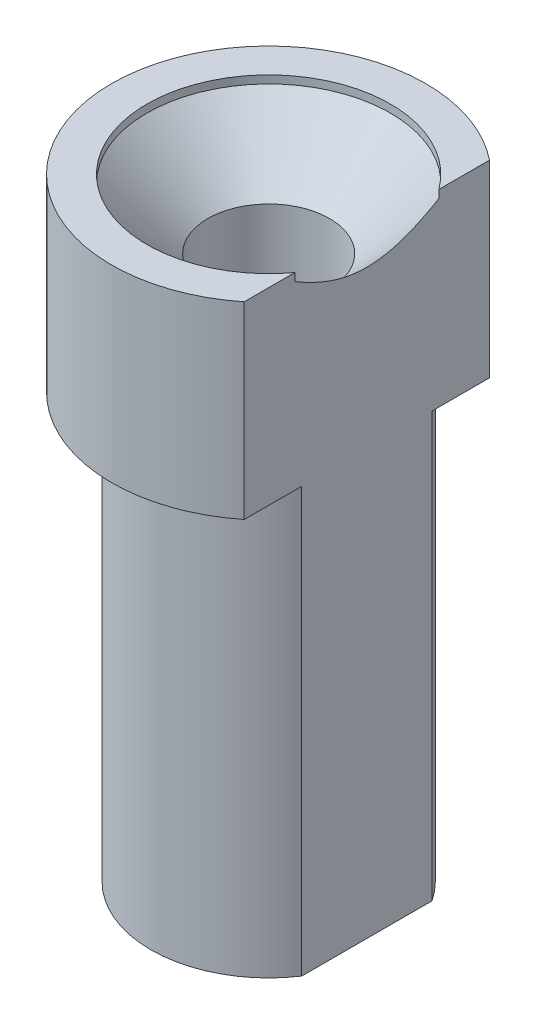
ISO-10303-21;
HEADER;
FILE_DESCRIPTION(('STEP AP214'),'2;1');
FILE_NAME('part.step','',(''),(''),'','','');
FILE_SCHEMA(('AUTOMOTIVE_DESIGN { 1 0 10303 214 1 1 1 1 }'));
ENDSEC;
DATA;
#1=APPLICATION_CONTEXT('core data for automotive mechanical design processes');
#2=APPLICATION_PROTOCOL_DEFINITION('international standard','automotive_design',2000,#1);
#3=PRODUCT_CONTEXT('',#1,'mechanical');
#4=PRODUCT('Part','Part','',(#3));
#5=PRODUCT_RELATED_PRODUCT_CATEGORY('part','',(#4));
#6=PRODUCT_DEFINITION_FORMATION('','',#4);
#7=PRODUCT_DEFINITION_CONTEXT('part definition',#1,'design');
#8=PRODUCT_DEFINITION('design','',#6,#7);
#9=PRODUCT_DEFINITION_SHAPE('','',#8);
#10=(LENGTH_UNIT() NAMED_UNIT(*) SI_UNIT(.MILLI.,.METRE.));
#11=(NAMED_UNIT(*) PLANE_ANGLE_UNIT() SI_UNIT($,.RADIAN.));
#12=(NAMED_UNIT(*) SI_UNIT($,.STERADIAN.) SOLID_ANGLE_UNIT());
#13=UNCERTAINTY_MEASURE_WITH_UNIT(LENGTH_MEASURE(1.E-05),#10,'distance_accuracy_value','');
#14=(GEOMETRIC_REPRESENTATION_CONTEXT(3) GLOBAL_UNCERTAINTY_ASSIGNED_CONTEXT((#13)) GLOBAL_UNIT_ASSIGNED_CONTEXT((#10,
#11,#12)) REPRESENTATION_CONTEXT('',''));
#15=CARTESIAN_POINT('',(0.,0.,0.));
#16=DIRECTION('',(0.,0.,1.));
#17=DIRECTION('',(1.,0.,0.));
#18=AXIS2_PLACEMENT_3D('',#15,#16,#17);
#19=CARTESIAN_POINT('',(0.,0.,0.));
#20=DIRECTION('',(0.,1.,0.));
#21=DIRECTION('',(0.,0.,1.));
#22=AXIS2_PLACEMENT_3D('',#19,#20,#21);
#23=CYLINDRICAL_SURFACE('',#22,3.);
#24=DIRECTION('',(0.,1.,0.));
#25=VECTOR('',#24,1.);
#26=CARTESIAN_POINT('',(-2.5,0.,1.6583123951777));
#27=LINE('',#26,#25);
#28=CARTESIAN_POINT('',(-2.5,0.,1.6583123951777));
#29=VERTEX_POINT('',#28);
#30=CARTESIAN_POINT('',(-2.5,5.1,1.6583123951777));
#31=VERTEX_POINT('',#30);
#32=EDGE_CURVE('E108',#29,#31,#27,.T.);
#33=ORIENTED_EDGE('',*,*,#32,.F.);
#34=CARTESIAN_POINT('',(0.,0.,0.));
#35=DIRECTION('',(0.,1.,0.));
#36=DIRECTION('',(0.,0.,1.));
#37=AXIS2_PLACEMENT_3D('',#34,#35,#36);
#38=CIRCLE('',#37,3.);
#39=CARTESIAN_POINT('',(2.5,0.,1.6583123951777));
#40=VERTEX_POINT('',#39);
#41=EDGE_CURVE('E117',#29,#40,#38,.T.);
#42=ORIENTED_EDGE('',*,*,#41,.T.);
#43=DIRECTION('',(0.,1.,0.));
#44=VECTOR('',#43,1.);
#45=CARTESIAN_POINT('',(2.5,0.,1.6583123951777));
#46=LINE('',#45,#44);
#47=CARTESIAN_POINT('',(2.5,10.8,1.6583123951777));
#48=VERTEX_POINT('',#47);
#49=EDGE_CURVE('E137',#48,#40,#46,.F.);
#50=ORIENTED_EDGE('',*,*,#49,.F.);
#51=CARTESIAN_POINT('',(0.,10.8,0.));
#52=DIRECTION('',(0.,1.,0.));
#53=DIRECTION('',(0.,0.,1.));
#54=AXIS2_PLACEMENT_3D('',#51,#52,#53);
#55=CIRCLE('',#54,3.);
#56=CARTESIAN_POINT('',(2.5,10.8,-1.6583123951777));
#57=VERTEX_POINT('',#56);
#58=EDGE_CURVE('E145',#57,#48,#55,.T.);
#59=ORIENTED_EDGE('',*,*,#58,.F.);
#60=DIRECTION('',(0.,1.,0.));
#61=VECTOR('',#60,1.);
#62=CARTESIAN_POINT('',(2.5,0.,-1.6583123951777));
#63=LINE('',#62,#61);
#64=CARTESIAN_POINT('',(2.5,0.,-1.6583123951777));
#65=VERTEX_POINT('',#64);
#66=EDGE_CURVE('E65',#65,#57,#63,.T.);
#67=ORIENTED_EDGE('',*,*,#66,.F.);
#68=CARTESIAN_POINT('',(-2.5,0.,-1.6583123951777));
#69=VERTEX_POINT('',#68);
#70=EDGE_CURVE('E123',#65,#69,#38,.T.);
#71=ORIENTED_EDGE('',*,*,#70,.T.);
#72=DIRECTION('',(0.,1.,0.));
#73=VECTOR('',#72,1.);
#74=CARTESIAN_POINT('',(-2.5,0.,-1.6583123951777));
#75=LINE('',#74,#73);
#76=CARTESIAN_POINT('',(-2.5,5.1,-1.6583123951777));
#77=VERTEX_POINT('',#76);
#78=EDGE_CURVE('E57',#77,#69,#75,.F.);
#79=ORIENTED_EDGE('',*,*,#78,.F.);
#80=CARTESIAN_POINT('',(0.,5.1,0.));
#81=DIRECTION('',(0.,1.,0.));
#82=DIRECTION('',(0.,0.,1.));
#83=AXIS2_PLACEMENT_3D('',#80,#81,#82);
#84=CIRCLE('',#83,3.);
#85=EDGE_CURVE('E11',#77,#31,#84,.T.);
#86=ORIENTED_EDGE('',*,*,#85,.T.);
#87=EDGE_LOOP('',(#33,#42,#50,#59,#67,#71,#79,#86));
#88=FACE_BOUND('',#87,.T.);
#89=ADVANCED_FACE('F43',(#88),#23,.T.);
#90=CARTESIAN_POINT('',(0.,0.,-1.55));
#91=DIRECTION('',(0.,1.,0.));
#92=DIRECTION('',(0.,0.,1.));
#93=AXIS2_PLACEMENT_3D('',#90,#91,#92);
#94=PLANE('',#93);
#95=CARTESIAN_POINT('',(0.,0.,0.));
#96=DIRECTION('',(0.,1.,0.));
#97=DIRECTION('',(0.,0.,1.));
#98=AXIS2_PLACEMENT_3D('',#95,#96,#97);
#99=CIRCLE('',#98,1.55);
#100=CARTESIAN_POINT('',(0.,0.,1.55));
#101=VERTEX_POINT('',#100);
#102=EDGE_CURVE('E124',#101,#101,#99,.T.);
#103=ORIENTED_EDGE('',*,*,#102,.T.);
#104=EDGE_LOOP('',(#103));
#105=FACE_BOUND('',#104,.T.);
#106=DIRECTION('',(0.,0.,1.));
#107=VECTOR('',#106,1.);
#108=CARTESIAN_POINT('',(-2.5,0.,-1.55));
#109=LINE('',#108,#107);
#110=EDGE_CURVE('E50',#69,#29,#109,.T.);
#111=ORIENTED_EDGE('',*,*,#110,.F.);
#112=ORIENTED_EDGE('',*,*,#70,.F.);
#113=DIRECTION('',(0.,0.,1.));
#114=VECTOR('',#113,1.);
#115=CARTESIAN_POINT('',(2.5,0.,6.44896517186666));
#116=LINE('',#115,#114);
#117=EDGE_CURVE('E119',#65,#40,#116,.T.);
#118=ORIENTED_EDGE('',*,*,#117,.T.);
#119=ORIENTED_EDGE('',*,*,#41,.F.);
#120=EDGE_LOOP('',(#111,#112,#118,#119));
#121=FACE_BOUND('',#120,.T.);
#122=ADVANCED_FACE('F122',(#105,#121),#94,.F.);
#123=CARTESIAN_POINT('',(0.,15.4,0.));
#124=DIRECTION('',(0.,1.,0.));
#125=DIRECTION('',(0.,0.,1.));
#126=AXIS2_PLACEMENT_3D('',#123,#124,#125);
#127=CONICAL_SURFACE('',#126,3.1,0.78539816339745);
#128=CARTESIAN_POINT('',(0.,13.85,0.));
#129=DIRECTION('',(0.,1.,0.));
#130=DIRECTION('',(0.,0.,1.));
#131=AXIS2_PLACEMENT_3D('',#128,#129,#130);
#132=CIRCLE('',#131,1.55);
#133=CARTESIAN_POINT('',(0.,13.85,1.55));
#134=VERTEX_POINT('',#133);
#135=EDGE_CURVE('E128',#134,#134,#132,.T.);
#136=ORIENTED_EDGE('',*,*,#135,.F.);
#137=EDGE_LOOP('',(#136));
#138=FACE_BOUND('',#137,.T.);
#139=CARTESIAN_POINT('',(2.5,17.52888082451,-4.59251507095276));
#140=CARTESIAN_POINT('',(2.5,17.4335333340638,-4.4839363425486));
#141=CARTESIAN_POINT('',(2.5,17.3386019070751,-4.37498826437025));
#142=CARTESIAN_POINT('',(2.5,17.1497957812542,-4.15615520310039));
#143=CARTESIAN_POINT('',(2.5,17.0559212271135,-4.04627009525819));
#144=CARTESIAN_POINT('',(2.5,16.8689517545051,-3.82476898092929));
#145=CARTESIAN_POINT('',(2.5,16.7758642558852,-3.71314669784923));
#146=CARTESIAN_POINT('',(2.5,16.5913616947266,-3.4885371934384));
#147=CARTESIAN_POINT('',(2.5,16.4999465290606,-3.37555005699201));
#148=CARTESIAN_POINT('',(2.5,16.3128963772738,-3.13987881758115));
#149=CARTESIAN_POINT('',(2.5,16.217416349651,-3.01707128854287));
#150=CARTESIAN_POINT('',(2.5,16.029711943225,-2.76899569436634));
#151=CARTESIAN_POINT('',(2.5,15.9374872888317,-2.64372783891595));
#152=CARTESIAN_POINT('',(2.5,15.7576881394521,-2.39030775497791));
#153=CARTESIAN_POINT('',(2.5,15.6701035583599,-2.2621627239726));
#154=CARTESIAN_POINT('',(2.5,15.5011800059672,-2.00184568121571));
#155=CARTESIAN_POINT('',(2.5,15.4198380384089,-1.86967564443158));
#156=CARTESIAN_POINT('',(2.5,15.2908857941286,-1.64347647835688));
#157=CARTESIAN_POINT('',(2.5,15.2408377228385,-1.55084456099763));
#158=CARTESIAN_POINT('',(2.5,15.1461523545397,-1.36278791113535));
#159=CARTESIAN_POINT('',(2.5,15.1015166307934,-1.26736237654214));
#160=CARTESIAN_POINT('',(2.5,15.0197454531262,-1.07450353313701));
#161=CARTESIAN_POINT('',(2.5,14.9825355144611,-0.97710222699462));
#162=CARTESIAN_POINT('',(2.5,14.9170025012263,-0.779343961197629));
#163=CARTESIAN_POINT('',(2.5,14.8886740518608,-0.678988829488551));
#164=CARTESIAN_POINT('',(2.5,14.8493647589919,-0.50431643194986));
#165=CARTESIAN_POINT('',(2.5,14.8357467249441,-0.430593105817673));
#166=CARTESIAN_POINT('',(2.5,14.8148126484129,-0.282253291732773));
#167=CARTESIAN_POINT('',(2.5,14.8074954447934,-0.207636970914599));
#168=CARTESIAN_POINT('',(2.5,14.7995637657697,-0.0581485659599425));
#169=CARTESIAN_POINT('',(2.5,14.798939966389,0.0167230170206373));
#170=CARTESIAN_POINT('',(2.5,14.8044058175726,0.166222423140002));
#171=CARTESIAN_POINT('',(2.5,14.8104959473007,0.240850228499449));
#172=CARTESIAN_POINT('',(2.5,14.8290002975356,0.388850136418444));
#173=CARTESIAN_POINT('',(2.5,14.8413763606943,0.462227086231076));
#174=CARTESIAN_POINT('',(2.5,14.8718357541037,0.607790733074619));
#175=CARTESIAN_POINT('',(2.5,14.8899206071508,0.679977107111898));
#176=CARTESIAN_POINT('',(2.5,14.9311264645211,0.823130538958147));
#177=CARTESIAN_POINT('',(2.5,14.9542633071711,0.894092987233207));
#178=CARTESIAN_POINT('',(2.5,15.0047800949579,1.0344676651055));
#179=CARTESIAN_POINT('',(2.5,15.0321597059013,1.10388001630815));
#180=CARTESIAN_POINT('',(2.5,15.1068147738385,1.27970226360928));
#181=CARTESIAN_POINT('',(2.5,15.1566365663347,1.38502869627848));
#182=CARTESIAN_POINT('',(2.5,15.2627356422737,1.59240189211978));
#183=CARTESIAN_POINT('',(2.5,15.3190170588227,1.69444650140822));
#184=CARTESIAN_POINT('',(2.5,15.4365403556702,1.89594165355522));
#185=CARTESIAN_POINT('',(2.5,15.4977937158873,1.9953854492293));
#186=CARTESIAN_POINT('',(2.5,15.6239534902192,2.19187936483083));
#187=CARTESIAN_POINT('',(2.5,15.688859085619,2.28893001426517));
#188=CARTESIAN_POINT('',(2.5,15.8224363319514,2.48244350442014));
#189=CARTESIAN_POINT('',(2.5,15.891148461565,2.57887827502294));
#190=CARTESIAN_POINT('',(2.5,16.0308383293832,2.77009270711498));
#191=CARTESIAN_POINT('',(2.5,16.1018161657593,2.86487229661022));
#192=CARTESIAN_POINT('',(2.5,16.2454573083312,3.05291836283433));
#193=CARTESIAN_POINT('',(2.5,16.3181179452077,3.14618688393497));
#194=CARTESIAN_POINT('',(2.5,16.4648781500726,3.33157701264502));
#195=CARTESIAN_POINT('',(2.5,16.5389776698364,3.42369865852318));
#196=CARTESIAN_POINT('',(2.5,16.7819031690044,3.72181003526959));
#197=CARTESIAN_POINT('',(2.5,16.9531011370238,3.92586607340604));
#198=CARTESIAN_POINT('',(2.5,17.2993769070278,4.33066663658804));
#199=CARTESIAN_POINT('',(2.5,17.4744550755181,4.53141084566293));
#200=CARTESIAN_POINT('',(2.5,17.827360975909,4.93055865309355));
#201=CARTESIAN_POINT('',(2.5,18.0051894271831,5.12896161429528));
#202=CARTESIAN_POINT('',(2.5,18.3628002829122,5.52399956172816));
#203=CARTESIAN_POINT('',(2.5,18.5425827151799,5.7206345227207));
#204=CARTESIAN_POINT('',(2.5,18.9038897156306,6.1128710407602));
#205=CARTESIAN_POINT('',(2.5,19.0854165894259,6.30847047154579));
#206=CARTESIAN_POINT('',(2.5,19.4495929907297,6.69862343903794));
#207=CARTESIAN_POINT('',(2.5,19.6322425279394,6.89317696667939));
#208=CARTESIAN_POINT('',(2.5,20.1814301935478,7.47554378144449));
#209=CARTESIAN_POINT('',(2.5,20.5492691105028,7.86212994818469));
#210=CARTESIAN_POINT('',(2.5,21.2484211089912,8.59267839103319));
#211=CARTESIAN_POINT('',(2.5,21.5795128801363,8.93685302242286));
#212=CARTESIAN_POINT('',(2.5,22.2429919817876,9.62398459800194));
#213=CARTESIAN_POINT('',(2.5,22.575379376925,9.96694147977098));
#214=CARTESIAN_POINT('',(2.5,23.2402541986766,10.6510872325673));
#215=CARTESIAN_POINT('',(2.5,23.5727392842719,10.9922783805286));
#216=CARTESIAN_POINT('',(2.5,24.2384093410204,11.673939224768));
#217=CARTESIAN_POINT('',(2.5,24.5715942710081,12.0144089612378));
#218=CARTESIAN_POINT('',(2.5,24.9050331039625,12.3546290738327));
#219=B_SPLINE_CURVE_WITH_KNOTS('',3,(#139,#140,#141,#142,#143,#144,#145,#146,#147,#148,#149,
#150,#151,#152,#153,#154,#155,#156,#157,#158,#159,#160,#161,#162,#163,#164,#165,#166,#167,#168,
#169,#170,#171,#172,#173,#174,#175,#176,#177,#178,#179,#180,#181,#182,#183,#184,#185,#186,#187,
#188,#189,#190,#191,#192,#193,#194,#195,#196,#197,#198,#199,#200,#201,#202,#203,#204,#205,#206,
#207,#208,#209,#210,#211,#212,#213,#214,#215,#216,#217,#218),.UNSPECIFIED.,.F.,.F.,(4,2,2,2,2,2,
2,2,2,2,2,2,2,2,2,2,2,2,2,2,2,2,2,2,2,2,2,2,2,2,2,2,2,2,2,2,2,2,2,4),(0.,0.433505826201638,
0.86707029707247,1.30308869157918,1.73908010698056,2.20571312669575,2.67230654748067,
3.13784019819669,3.603148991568,3.91887967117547,4.23470190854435,4.54717656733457,
4.8594617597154,5.08413450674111,5.30876584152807,5.53308422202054,5.75741861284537,
5.98040722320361,6.20345536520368,6.42721308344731,6.65095318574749,7.00017624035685,
7.34962399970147,7.69990290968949,8.05010360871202,8.40529325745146,8.76049831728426,
9.11517404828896,9.46983791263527,10.2688306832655,11.067899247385,11.8671804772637,
12.6664730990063,13.4670298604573,14.2675935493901,15.8684483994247,17.3011702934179,
18.7339645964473,20.163165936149,21.5922854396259),.UNSPECIFIED.);
#220=CARTESIAN_POINT('',(2.5,15.4,-1.83303027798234));
#221=VERTEX_POINT('',#220);
#222=CARTESIAN_POINT('',(2.5,15.4,1.83303027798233));
#223=VERTEX_POINT('',#222);
#224=EDGE_CURVE('E156',#221,#223,#219,.T.);
#225=ORIENTED_EDGE('',*,*,#224,.F.);
#226=CARTESIAN_POINT('',(0.,15.4,0.));
#227=DIRECTION('',(0.,1.,0.));
#228=DIRECTION('',(0.,0.,1.));
#229=AXIS2_PLACEMENT_3D('',#226,#227,#228);
#230=CIRCLE('',#229,3.1);
#231=EDGE_CURVE('E165',#221,#223,#230,.T.);
#232=ORIENTED_EDGE('',*,*,#231,.T.);
#233=EDGE_LOOP('',(#225,#232));
#234=FACE_BOUND('',#233,.T.);
#235=ADVANCED_FACE('F172',(#138,#234),#127,.F.);
#236=CARTESIAN_POINT('',(0.,0.,0.));
#237=DIRECTION('',(0.,1.,0.));
#238=DIRECTION('',(0.,0.,1.));
#239=AXIS2_PLACEMENT_3D('',#236,#237,#238);
#240=CYLINDRICAL_SURFACE('',#239,3.1);
#241=DIRECTION('',(0.,1.,0.));
#242=VECTOR('',#241,1.);
#243=CARTESIAN_POINT('',(2.5,0.,-1.83303027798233));
#244=LINE('',#243,#242);
#245=CARTESIAN_POINT('',(2.5,15.6,-1.83303027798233));
#246=VERTEX_POINT('',#245);
#247=EDGE_CURVE('E151',#246,#221,#244,.F.);
#248=ORIENTED_EDGE('',*,*,#247,.F.);
#249=CARTESIAN_POINT('',(0.,15.6,0.));
#250=DIRECTION('',(0.,1.,0.));
#251=DIRECTION('',(0.,0.,1.));
#252=AXIS2_PLACEMENT_3D('',#249,#250,#251);
#253=CIRCLE('',#252,3.1);
#254=CARTESIAN_POINT('',(2.5,15.6,1.83303027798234));
#255=VERTEX_POINT('',#254);
#256=EDGE_CURVE('E162',#246,#255,#253,.T.);
#257=ORIENTED_EDGE('',*,*,#256,.T.);
#258=DIRECTION('',(0.,1.,0.));
#259=VECTOR('',#258,1.);
#260=CARTESIAN_POINT('',(2.5,0.,1.83303027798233));
#261=LINE('',#260,#259);
#262=EDGE_CURVE('E146',#223,#255,#261,.T.);
#263=ORIENTED_EDGE('',*,*,#262,.F.);
#264=ORIENTED_EDGE('',*,*,#231,.F.);
#265=EDGE_LOOP('',(#248,#257,#263,#264));
#266=FACE_BOUND('',#265,.T.);
#267=ADVANCED_FACE('F175',(#266),#240,.F.);
#268=CARTESIAN_POINT('',(0.,15.6,-4.));
#269=DIRECTION('',(0.,-1.,0.));
#270=DIRECTION('',(0.,0.,-1.));
#271=AXIS2_PLACEMENT_3D('',#268,#269,#270);
#272=PLANE('',#271);
#273=DIRECTION('',(0.,0.,1.));
#274=VECTOR('',#273,1.);
#275=CARTESIAN_POINT('',(2.5,15.6,6.44896517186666));
#276=LINE('',#275,#274);
#277=CARTESIAN_POINT('',(2.5,15.6,-3.1224989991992));
#278=VERTEX_POINT('',#277);
#279=EDGE_CURVE('E294',#278,#246,#276,.T.);
#280=ORIENTED_EDGE('',*,*,#279,.F.);
#281=CARTESIAN_POINT('',(0.,15.6,0.));
#282=DIRECTION('',(0.,1.,0.));
#283=DIRECTION('',(0.,0.,1.));
#284=AXIS2_PLACEMENT_3D('',#281,#282,#283);
#285=CIRCLE('',#284,4.);
#286=CARTESIAN_POINT('',(2.5,15.6,3.1224989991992));
#287=VERTEX_POINT('',#286);
#288=EDGE_CURVE('E154',#278,#287,#285,.T.);
#289=ORIENTED_EDGE('',*,*,#288,.T.);
#290=EDGE_CURVE('E292',#255,#287,#276,.T.);
#291=ORIENTED_EDGE('',*,*,#290,.F.);
#292=ORIENTED_EDGE('',*,*,#256,.F.);
#293=EDGE_LOOP('',(#280,#289,#291,#292));
#294=FACE_BOUND('',#293,.T.);
#295=ADVANCED_FACE('F204',(#294),#272,.F.);
#296=CARTESIAN_POINT('',(0.,0.,0.));
#297=DIRECTION('',(0.,1.,0.));
#298=DIRECTION('',(0.,0.,1.));
#299=AXIS2_PLACEMENT_3D('',#296,#297,#298);
#300=CYLINDRICAL_SURFACE('',#299,4.);
#301=DIRECTION('',(0.,1.,0.));
#302=VECTOR('',#301,1.);
#303=CARTESIAN_POINT('',(2.5,0.,-3.1224989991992));
#304=LINE('',#303,#302);
#305=CARTESIAN_POINT('',(2.5,10.8,-3.1224989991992));
#306=VERTEX_POINT('',#305);
#307=EDGE_CURVE('E296',#306,#278,#304,.T.);
#308=ORIENTED_EDGE('',*,*,#307,.F.);
#309=CARTESIAN_POINT('',(0.,10.8,0.));
#310=DIRECTION('',(0.,1.,0.));
#311=DIRECTION('',(0.,0.,1.));
#312=AXIS2_PLACEMENT_3D('',#309,#310,#311);
#313=CIRCLE('',#312,4.);
#314=CARTESIAN_POINT('',(2.5,10.8,3.1224989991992));
#315=VERTEX_POINT('',#314);
#316=EDGE_CURVE('E150',#306,#315,#313,.T.);
#317=ORIENTED_EDGE('',*,*,#316,.T.);
#318=DIRECTION('',(0.,1.,0.));
#319=VECTOR('',#318,1.);
#320=CARTESIAN_POINT('',(2.5,0.,3.1224989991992));
#321=LINE('',#320,#319);
#322=EDGE_CURVE('E139',#287,#315,#321,.F.);
#323=ORIENTED_EDGE('',*,*,#322,.F.);
#324=ORIENTED_EDGE('',*,*,#288,.F.);
#325=EDGE_LOOP('',(#308,#317,#323,#324));
#326=FACE_BOUND('',#325,.T.);
#327=ADVANCED_FACE('F201',(#326),#300,.T.);
#328=CARTESIAN_POINT('',(0.,10.8,-3.));
#329=DIRECTION('',(0.,1.,0.));
#330=DIRECTION('',(0.,0.,1.));
#331=AXIS2_PLACEMENT_3D('',#328,#329,#330);
#332=PLANE('',#331);
#333=DIRECTION('',(0.,0.,-1.));
#334=VECTOR('',#333,1.);
#335=CARTESIAN_POINT('',(2.5,10.8,-3.));
#336=LINE('',#335,#334);
#337=EDGE_CURVE('E114',#315,#48,#336,.T.);
#338=ORIENTED_EDGE('',*,*,#337,.F.);
#339=ORIENTED_EDGE('',*,*,#316,.F.);
#340=EDGE_CURVE('E126',#57,#306,#336,.T.);
#341=ORIENTED_EDGE('',*,*,#340,.F.);
#342=ORIENTED_EDGE('',*,*,#58,.T.);
#343=EDGE_LOOP('',(#338,#339,#341,#342));
#344=FACE_BOUND('',#343,.T.);
#345=ADVANCED_FACE('F148',(#344),#332,.F.);
#346=CARTESIAN_POINT('',(0.,0.,0.));
#347=DIRECTION('',(0.,1.,0.));
#348=DIRECTION('',(0.,0.,1.));
#349=AXIS2_PLACEMENT_3D('',#346,#347,#348);
#350=CYLINDRICAL_SURFACE('',#349,1.55);
#351=ORIENTED_EDGE('',*,*,#102,.F.);
#352=EDGE_LOOP('',(#351));
#353=FACE_BOUND('',#352,.T.);
#354=ORIENTED_EDGE('',*,*,#135,.T.);
#355=EDGE_LOOP('',(#354));
#356=FACE_BOUND('',#355,.T.);
#357=ADVANCED_FACE('F170',(#353,#356),#350,.F.);
#358=CARTESIAN_POINT('',(2.5,15.6,6.44896517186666));
#359=DIRECTION('',(1.,0.,0.));
#360=DIRECTION('',(0.,0.,-1.));
#361=AXIS2_PLACEMENT_3D('',#358,#359,#360);
#362=PLANE('',#361);
#363=ORIENTED_EDGE('',*,*,#247,.T.);
#364=ORIENTED_EDGE('',*,*,#224,.T.);
#365=ORIENTED_EDGE('',*,*,#262,.T.);
#366=ORIENTED_EDGE('',*,*,#290,.T.);
#367=ORIENTED_EDGE('',*,*,#322,.T.);
#368=ORIENTED_EDGE('',*,*,#337,.T.);
#369=ORIENTED_EDGE('',*,*,#49,.T.);
#370=ORIENTED_EDGE('',*,*,#117,.F.);
#371=ORIENTED_EDGE('',*,*,#66,.T.);
#372=ORIENTED_EDGE('',*,*,#340,.T.);
#373=ORIENTED_EDGE('',*,*,#307,.T.);
#374=ORIENTED_EDGE('',*,*,#279,.T.);
#375=EDGE_LOOP('',(#363,#364,#365,#366,#367,#368,#369,#370,#371,#372,#373,#374));
#376=FACE_BOUND('',#375,.T.);
#377=ADVANCED_FACE('F136',(#376),#362,.T.);
#378=CARTESIAN_POINT('',(0.,5.1,0.));
#379=DIRECTION('',(0.,1.,0.));
#380=DIRECTION('',(0.,0.,1.));
#381=AXIS2_PLACEMENT_3D('',#378,#379,#380);
#382=PLANE('',#381);
#383=DIRECTION('',(0.,0.,-1.));
#384=VECTOR('',#383,1.);
#385=CARTESIAN_POINT('',(-2.5,5.1,-5.));
#386=LINE('',#385,#384);
#387=EDGE_CURVE('E288',#31,#77,#386,.T.);
#388=ORIENTED_EDGE('',*,*,#387,.F.);
#389=ORIENTED_EDGE('',*,*,#85,.F.);
#390=EDGE_LOOP('',(#388,#389));
#391=FACE_BOUND('',#390,.T.);
#392=ADVANCED_FACE('F197',(#391),#382,.F.);
#393=CARTESIAN_POINT('',(-2.5,5.1,-5.));
#394=DIRECTION('',(-1.,0.,0.));
#395=DIRECTION('',(0.,0.,1.));
#396=AXIS2_PLACEMENT_3D('',#393,#394,#395);
#397=PLANE('',#396);
#398=ORIENTED_EDGE('',*,*,#32,.T.);
#399=ORIENTED_EDGE('',*,*,#387,.T.);
#400=ORIENTED_EDGE('',*,*,#78,.T.);
#401=ORIENTED_EDGE('',*,*,#110,.T.);
#402=EDGE_LOOP('',(#398,#399,#400,#401));
#403=FACE_BOUND('',#402,.T.);
#404=ADVANCED_FACE('F107',(#403),#397,.T.);
#405=CLOSED_SHELL('',(#89,#122,#235,#267,#295,#327,#345,#357,#377,#392,#404));
#406=MANIFOLD_SOLID_BREP('B2',#405);
#407=ADVANCED_BREP_SHAPE_REPRESENTATION('',(#18,#406),#14);
#408=SHAPE_DEFINITION_REPRESENTATION(#9,#407);
ENDSEC;
END-ISO-10303-21;
